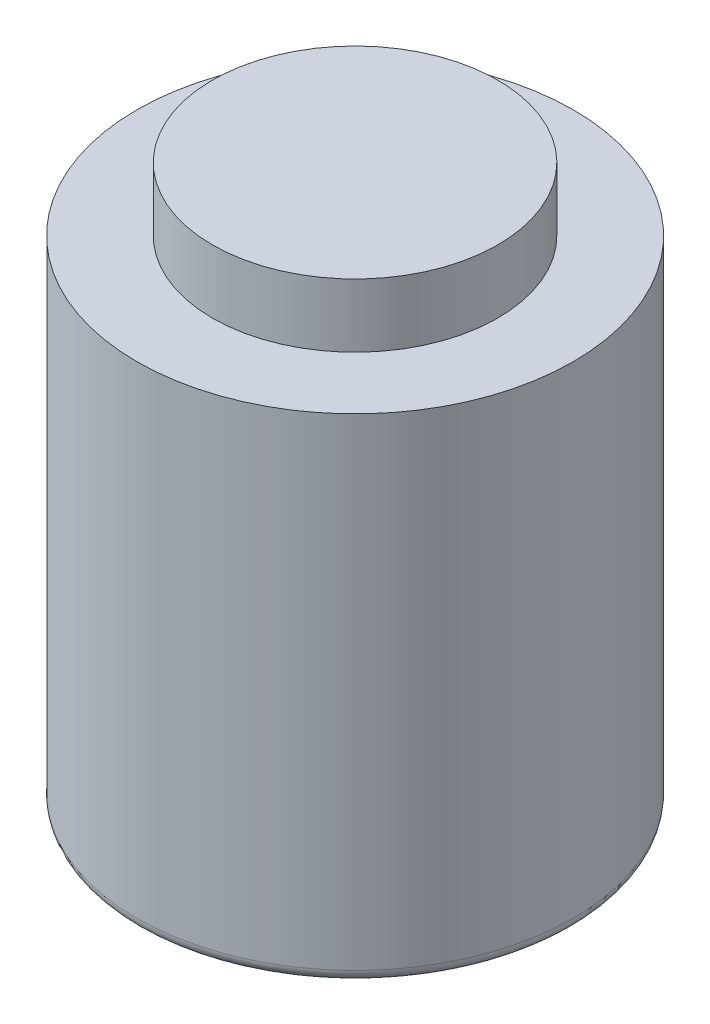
from build123d import *

# Parameters (mm, degrees)
ESBO_O1_R                = 17.2
RESSALTO_EXTRUS_O1_DEPTH = 39
ESBO_O2_R                = 11.25
RESSALTO_EXTRUS_O2_DEPTH = 5
ESBO_O3_R                = 4
RESSALTO_EXTRUS_O3_DEPTH = 3
ESBO_O5_R                = 1
RESSALTO_EXTRUS_O4_DEPTH = 7
PADR_OCIRCULAR1_COUNT    = 6
FILETE1_R                = 1


with BuildPart() as part:
    # Esbo_o1 → Ressalto-extrus_o1 (new body)
    with BuildSketch(Plane(origin=(0, 0, 0), x_dir=(1, 0, 0), z_dir=(0, 1, 0))):
        with Locations(Location((0, 0, 0), (0, 0, 270))):
            Circle(ESBO_O1_R)
    extrude(amount=RESSALTO_EXTRUS_O1_DEPTH)

    # Esbo_o2 → Ressalto-extrus_o2 (add)
    with BuildSketch(Plane(origin=(0, 39, 0), x_dir=(1, 0, 0), z_dir=(0, 1, 0))):
        with Locations(Location((0, 0, 0), (0, 0, 270))):
            Circle(ESBO_O2_R)
    extrude(amount=RESSALTO_EXTRUS_O2_DEPTH)

    # Esbo_o3 → Ressalto-extrus_o3 (add)
    with BuildSketch(Plane.XZ):
        with Locations(Location((0, 0, 0), (0, 0, 270))):
            Circle(ESBO_O3_R)
    extrude(amount=RESSALTO_EXTRUS_O3_DEPTH)

    # Esbo_o5 → Ressalto-extrus_o4 (add)
    with BuildSketch(Plane.XZ.offset(3)):
        with Locations(Location((0, 0, 0), (0, 0, 270))):
            Circle(ESBO_O5_R)
    extrude(amount=RESSALTO_EXTRUS_O4_DEPTH)

    # Esbo_o7 → Furo roscado de M2.51 (revolve, cut)
    with BuildSketch(Plane(origin=(0, 0, 13.5), x_dir=(0, 0, -1), z_dir=(1, 0, 0))):
        Polygon((0, 0), (0, 6), (1.025, 5.384117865), (1.025, 0), align=None)
    furo_roscado_de_m2_51 = revolve(axis=Axis((0, -6.35, 13.5), (0, 1, 0)), mode=Mode.SUBTRACT)

    # Padr_oCircular1: Furo roscado de M2.51 ×6 about axis
    padr_ocircular1_axis = Axis((0, 0, 0), (0, 1, 0))
    for i in range(1, PADR_OCIRCULAR1_COUNT):
        add(furo_roscado_de_m2_51.rotate(padr_ocircular1_axis, i * 360 / PADR_OCIRCULAR1_COUNT), mode=Mode.SUBTRACT)

    # Filete1
    filete1_edges = [part.edges().sort_by_distance(p)[0] for p in [
        (0, 0, -17.2),
    ]]
    fillet(filete1_edges, radius=FILETE1_R)


solid = part.part
